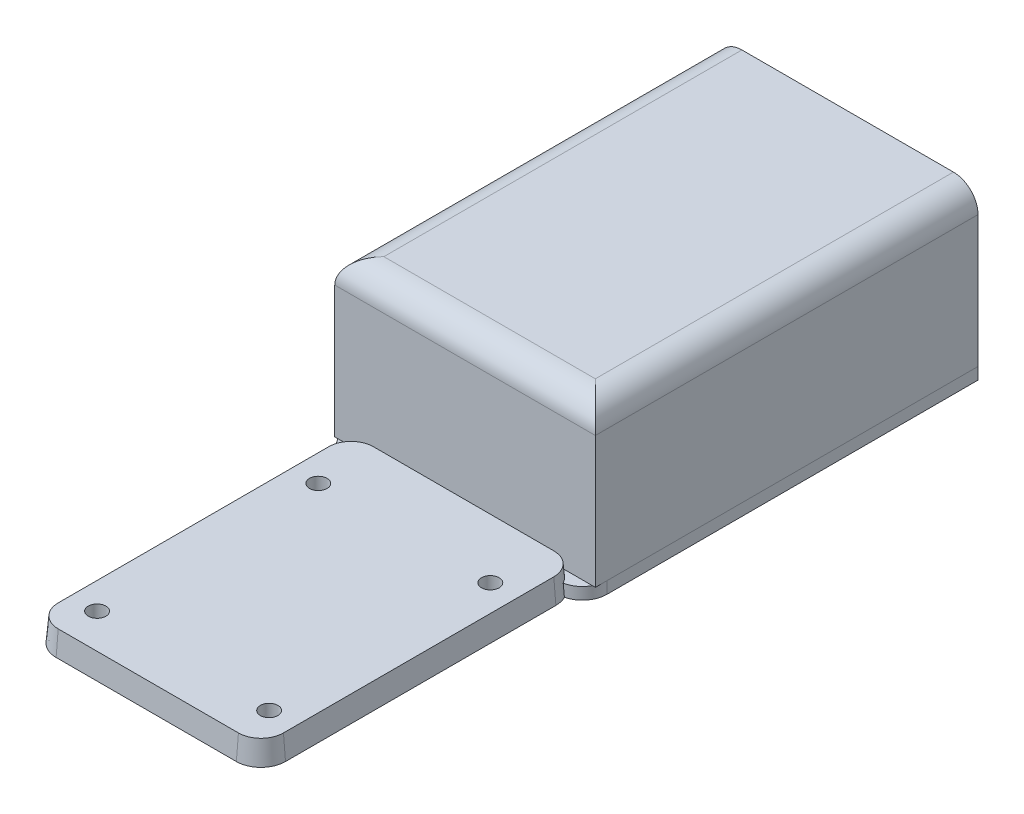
ISO-10303-21;
HEADER;
FILE_DESCRIPTION(('STEP AP214'),'2;1');
FILE_NAME('part.step','',(''),(''),'','','');
FILE_SCHEMA(('AUTOMOTIVE_DESIGN { 1 0 10303 214 1 1 1 1 }'));
ENDSEC;
DATA;
#1=APPLICATION_CONTEXT('core data for automotive mechanical design processes');
#2=APPLICATION_PROTOCOL_DEFINITION('international standard','automotive_design',2000,#1);
#3=PRODUCT_CONTEXT('',#1,'mechanical');
#4=PRODUCT('Part','Part','',(#3));
#5=PRODUCT_RELATED_PRODUCT_CATEGORY('part','',(#4));
#6=PRODUCT_DEFINITION_FORMATION('','',#4);
#7=PRODUCT_DEFINITION_CONTEXT('part definition',#1,'design');
#8=PRODUCT_DEFINITION('design','',#6,#7);
#9=PRODUCT_DEFINITION_SHAPE('','',#8);
#10=(LENGTH_UNIT() NAMED_UNIT(*) SI_UNIT(.MILLI.,.METRE.));
#11=(NAMED_UNIT(*) PLANE_ANGLE_UNIT() SI_UNIT($,.RADIAN.));
#12=(NAMED_UNIT(*) SI_UNIT($,.STERADIAN.) SOLID_ANGLE_UNIT());
#13=UNCERTAINTY_MEASURE_WITH_UNIT(LENGTH_MEASURE(1.E-05),#10,'distance_accuracy_value','');
#14=(GEOMETRIC_REPRESENTATION_CONTEXT(3) GLOBAL_UNCERTAINTY_ASSIGNED_CONTEXT((#13)) GLOBAL_UNIT_ASSIGNED_CONTEXT((#10,
#11,#12)) REPRESENTATION_CONTEXT('',''));
#15=CARTESIAN_POINT('',(0.,0.,0.));
#16=DIRECTION('',(0.,0.,1.));
#17=DIRECTION('',(1.,0.,0.));
#18=AXIS2_PLACEMENT_3D('',#15,#16,#17);
#19=CARTESIAN_POINT('',(25.8877703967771,2.9,-41.5875747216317));
#20=DIRECTION('',(0.,-1.,0.));
#21=DIRECTION('',(0.,0.,-1.));
#22=AXIS2_PLACEMENT_3D('',#19,#20,#21);
#23=PLANE('',#22);
#24=DIRECTION('',(-1.,0.,0.));
#25=VECTOR('',#24,1.);
#26=CARTESIAN_POINT('',(25.8877703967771,2.9,-132.150001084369));
#27=LINE('',#26,#25);
#28=CARTESIAN_POINT('',(31.8877703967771,2.9,-132.150001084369));
#29=VERTEX_POINT('',#28);
#30=CARTESIAN_POINT('',(-31.6747409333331,2.9,-132.150001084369));
#31=VERTEX_POINT('',#30);
#32=EDGE_CURVE('E527',#29,#31,#27,.T.);
#33=ORIENTED_EDGE('',*,*,#32,.F.);
#34=DIRECTION('',(0.,0.,1.));
#35=VECTOR('',#34,1.);
#36=CARTESIAN_POINT('',(31.8877703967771,2.9,-41.5875747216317));
#37=LINE('',#36,#35);
#38=CARTESIAN_POINT('',(31.8877703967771,2.9,-132.155434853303));
#39=VERTEX_POINT('',#38);
#40=EDGE_CURVE('E306',#39,#29,#37,.T.);
#41=ORIENTED_EDGE('',*,*,#40,.F.);
#42=DIRECTION('',(1.,0.,0.));
#43=VECTOR('',#42,1.);
#44=CARTESIAN_POINT('',(-31.6747409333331,2.9,-132.155434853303));
#45=LINE('',#44,#43);
#46=CARTESIAN_POINT('',(-31.6747409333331,2.9,-132.155434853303));
#47=VERTEX_POINT('',#46);
#48=EDGE_CURVE('E302',#47,#39,#45,.T.);
#49=ORIENTED_EDGE('',*,*,#48,.F.);
#50=DIRECTION('',(0.,0.,-1.));
#51=VECTOR('',#50,1.);
#52=CARTESIAN_POINT('',(-31.6747409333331,2.9,-41.5875747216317));
#53=LINE('',#52,#51);
#54=EDGE_CURVE('E298',#31,#47,#53,.T.);
#55=ORIENTED_EDGE('',*,*,#54,.F.);
#56=EDGE_LOOP('',(#33,#41,#49,#55));
#57=FACE_BOUND('',#56,.T.);
#58=ADVANCED_FACE('F34',(#57),#23,.F.);
#59=DIRECTION('',(1.,0.,0.));
#60=VECTOR('',#59,1.);
#61=CARTESIAN_POINT('',(25.8877703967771,2.9,-38.7462828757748));
#62=LINE('',#61,#60);
#63=CARTESIAN_POINT('',(-30.9593469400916,2.9,-38.7462828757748));
#64=VERTEX_POINT('',#63);
#65=CARTESIAN_POINT('',(-22.,2.9,-38.7462828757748));
#66=VERTEX_POINT('',#65);
#67=EDGE_CURVE('E430',#64,#66,#62,.T.);
#68=ORIENTED_EDGE('',*,*,#67,.F.);
#69=CARTESIAN_POINT('',(-25.6747409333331,2.9,-41.5875747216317));
#70=DIRECTION('',(0.,-1.,0.));
#71=DIRECTION('',(0.,0.,1.));
#72=AXIS2_PLACEMENT_3D('',#69,#70,#71);
#73=CIRCLE('',#72,6.);
#74=CARTESIAN_POINT('',(-27.0473257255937,2.9,-35.7466834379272));
#75=VERTEX_POINT('',#74);
#76=EDGE_CURVE('E295',#75,#64,#73,.T.);
#77=ORIENTED_EDGE('',*,*,#76,.F.);
#78=CARTESIAN_POINT('',(-22.,2.9,-33.));
#79=DIRECTION('',(0.,-1.,0.));
#80=DIRECTION('',(0.,0.,-1.));
#81=AXIS2_PLACEMENT_3D('',#78,#79,#80);
#82=CIRCLE('',#81,5.74628287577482);
#83=EDGE_CURVE('E431',#75,#66,#82,.T.);
#84=ORIENTED_EDGE('',*,*,#83,.T.);
#85=EDGE_LOOP('',(#68,#77,#84));
#86=FACE_BOUND('',#85,.T.);
#87=ADVANCED_FACE('F403',(#86),#23,.F.);
#88=CARTESIAN_POINT('',(22.,2.9,-38.7462828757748));
#89=VERTEX_POINT('',#88);
#90=CARTESIAN_POINT('',(31.1723764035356,2.9,-38.7462828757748));
#91=VERTEX_POINT('',#90);
#92=EDGE_CURVE('E423',#89,#91,#62,.T.);
#93=ORIENTED_EDGE('',*,*,#92,.F.);
#94=CARTESIAN_POINT('',(22.,2.9,-33.));
#95=DIRECTION('',(0.,-1.,0.));
#96=DIRECTION('',(0.,0.,-1.));
#97=AXIS2_PLACEMENT_3D('',#94,#95,#96);
#98=CIRCLE('',#97,5.74628287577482);
#99=CARTESIAN_POINT('',(27.0697114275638,2.9,-35.7051419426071));
#100=VERTEX_POINT('',#99);
#101=EDGE_CURVE('E425',#89,#100,#98,.T.);
#102=ORIENTED_EDGE('',*,*,#101,.T.);
#103=CARTESIAN_POINT('',(25.8877703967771,2.9,-41.5875747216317));
#104=DIRECTION('',(0.,-1.,0.));
#105=DIRECTION('',(0.,0.,-1.));
#106=AXIS2_PLACEMENT_3D('',#103,#104,#105);
#107=CIRCLE('',#106,5.99999999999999);
#108=EDGE_CURVE('E294',#91,#100,#107,.T.);
#109=ORIENTED_EDGE('',*,*,#108,.F.);
#110=EDGE_LOOP('',(#93,#102,#109));
#111=FACE_BOUND('',#110,.T.);
#112=ADVANCED_FACE('F406',(#111),#23,.F.);
#113=CARTESIAN_POINT('',(22.,0.,-39.));
#114=DIRECTION('',(0.,0.0871557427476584,-0.996194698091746));
#115=DIRECTION('',(0.,0.996194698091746,0.0871557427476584));
#116=AXIS2_PLACEMENT_3D('',#113,#114,#115);
#117=PLANE('',#116);
#118=DIRECTION('',(-1.,0.,0.));
#119=VECTOR('',#118,1.);
#120=CARTESIAN_POINT('',(22.,2.9,-38.7462828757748));
#121=LINE('',#120,#119);
#122=EDGE_CURVE('E442',#66,#89,#121,.F.);
#123=ORIENTED_EDGE('',*,*,#122,.F.);
#124=DIRECTION('',(0.,-0.996194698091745,-0.0871557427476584));
#125=VECTOR('',#124,1.);
#126=CARTESIAN_POINT('',(-22.,0.,-39.));
#127=LINE('',#126,#125);
#128=CARTESIAN_POINT('',(-22.,5.8,-38.4925657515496));
#129=VERTEX_POINT('',#128);
#130=EDGE_CURVE('E448',#129,#66,#127,.T.);
#131=ORIENTED_EDGE('',*,*,#130,.F.);
#132=DIRECTION('',(1.,0.,0.));
#133=VECTOR('',#132,1.);
#134=CARTESIAN_POINT('',(22.,5.8,-38.4925657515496));
#135=LINE('',#134,#133);
#136=CARTESIAN_POINT('',(22.,5.8,-38.4925657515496));
#137=VERTEX_POINT('',#136);
#138=EDGE_CURVE('E446',#137,#129,#135,.F.);
#139=ORIENTED_EDGE('',*,*,#138,.F.);
#140=DIRECTION('',(0.,-0.996194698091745,-0.0871557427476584));
#141=VECTOR('',#140,1.);
#142=CARTESIAN_POINT('',(22.,0.,-39.));
#143=LINE('',#142,#141);
#144=EDGE_CURVE('E438',#137,#89,#143,.T.);
#145=ORIENTED_EDGE('',*,*,#144,.T.);
#146=EDGE_LOOP('',(#123,#131,#139,#145));
#147=FACE_BOUND('',#146,.T.);
#148=ADVANCED_FACE('F391',(#147),#117,.T.);
#149=CARTESIAN_POINT('',(-22.,0.,33.));
#150=DIRECTION('',(0.,-1.,0.));
#151=DIRECTION('',(0.,0.,1.));
#152=AXIS2_PLACEMENT_3D('',#149,#150,#151);
#153=CONICAL_SURFACE('',#152,6.,0.0872664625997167);
#154=CARTESIAN_POINT('',(-22.,0.,33.));
#155=DIRECTION('',(0.,1.,0.));
#156=DIRECTION('',(0.,0.,1.));
#157=AXIS2_PLACEMENT_3D('',#154,#155,#156);
#158=CIRCLE('',#157,6.);
#159=CARTESIAN_POINT('',(-28.,0.,33.));
#160=VERTEX_POINT('',#159);
#161=CARTESIAN_POINT('',(-22.,0.,39.));
#162=VERTEX_POINT('',#161);
#163=EDGE_CURVE('E476',#160,#162,#158,.T.);
#164=ORIENTED_EDGE('',*,*,#163,.T.);
#165=DIRECTION('',(0.,-0.996194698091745,0.0871557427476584));
#166=VECTOR('',#165,1.);
#167=CARTESIAN_POINT('',(-22.,0.,39.));
#168=LINE('',#167,#166);
#169=CARTESIAN_POINT('',(-22.,5.8,38.4925657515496));
#170=VERTEX_POINT('',#169);
#171=EDGE_CURVE('E492',#170,#162,#168,.T.);
#172=ORIENTED_EDGE('',*,*,#171,.F.);
#173=CARTESIAN_POINT('',(-22.,5.8,33.));
#174=DIRECTION('',(0.,1.,0.));
#175=DIRECTION('',(0.,0.,1.));
#176=AXIS2_PLACEMENT_3D('',#173,#174,#175);
#177=CIRCLE('',#176,5.49256575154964);
#178=CARTESIAN_POINT('',(-27.4925657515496,5.8,33.));
#179=VERTEX_POINT('',#178);
#180=EDGE_CURVE('E491',#179,#170,#177,.T.);
#181=ORIENTED_EDGE('',*,*,#180,.F.);
#182=DIRECTION('',(-0.0871557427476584,-0.996194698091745,0.));
#183=VECTOR('',#182,1.);
#184=CARTESIAN_POINT('',(-28.,0.,33.));
#185=LINE('',#184,#183);
#186=EDGE_CURVE('E496',#179,#160,#185,.T.);
#187=ORIENTED_EDGE('',*,*,#186,.T.);
#188=EDGE_LOOP('',(#164,#172,#181,#187));
#189=FACE_BOUND('',#188,.T.);
#190=ADVANCED_FACE('F388',(#189),#153,.T.);
#191=CARTESIAN_POINT('',(22.,0.,39.));
#192=DIRECTION('',(0.,0.0871557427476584,0.996194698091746));
#193=DIRECTION('',(0.,-0.996194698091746,0.0871557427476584));
#194=AXIS2_PLACEMENT_3D('',#191,#192,#193);
#195=PLANE('',#194);
#196=DIRECTION('',(1.,0.,0.));
#197=VECTOR('',#196,1.);
#198=CARTESIAN_POINT('',(22.,0.,39.));
#199=LINE('',#198,#197);
#200=CARTESIAN_POINT('',(22.,0.,39.));
#201=VERTEX_POINT('',#200);
#202=EDGE_CURVE('E479',#162,#201,#199,.T.);
#203=ORIENTED_EDGE('',*,*,#202,.T.);
#204=DIRECTION('',(0.,-0.996194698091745,0.0871557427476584));
#205=VECTOR('',#204,1.);
#206=CARTESIAN_POINT('',(22.,0.,39.));
#207=LINE('',#206,#205);
#208=CARTESIAN_POINT('',(22.,5.8,38.4925657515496));
#209=VERTEX_POINT('',#208);
#210=EDGE_CURVE('E495',#209,#201,#207,.T.);
#211=ORIENTED_EDGE('',*,*,#210,.F.);
#212=DIRECTION('',(-1.,0.,0.));
#213=VECTOR('',#212,1.);
#214=CARTESIAN_POINT('',(22.,5.8,38.4925657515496));
#215=LINE('',#214,#213);
#216=EDGE_CURVE('E513',#170,#209,#215,.F.);
#217=ORIENTED_EDGE('',*,*,#216,.F.);
#218=ORIENTED_EDGE('',*,*,#171,.T.);
#219=EDGE_LOOP('',(#203,#211,#217,#218));
#220=FACE_BOUND('',#219,.T.);
#221=ADVANCED_FACE('F390',(#220),#195,.T.);
#222=CARTESIAN_POINT('',(22.,0.,33.));
#223=DIRECTION('',(0.,-1.,0.));
#224=DIRECTION('',(0.,0.,1.));
#225=AXIS2_PLACEMENT_3D('',#222,#223,#224);
#226=CONICAL_SURFACE('',#225,6.,0.0872664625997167);
#227=CARTESIAN_POINT('',(22.,0.,33.));
#228=DIRECTION('',(0.,1.,0.));
#229=DIRECTION('',(0.,0.,1.));
#230=AXIS2_PLACEMENT_3D('',#227,#228,#229);
#231=CIRCLE('',#230,6.);
#232=CARTESIAN_POINT('',(28.,0.,33.));
#233=VERTEX_POINT('',#232);
#234=EDGE_CURVE('E481',#201,#233,#231,.T.);
#235=ORIENTED_EDGE('',*,*,#234,.T.);
#236=DIRECTION('',(0.0871557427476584,-0.996194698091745,0.));
#237=VECTOR('',#236,1.);
#238=CARTESIAN_POINT('',(28.,0.,33.));
#239=LINE('',#238,#237);
#240=CARTESIAN_POINT('',(27.4925657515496,5.8,33.));
#241=VERTEX_POINT('',#240);
#242=EDGE_CURVE('E506',#241,#233,#239,.T.);
#243=ORIENTED_EDGE('',*,*,#242,.F.);
#244=CARTESIAN_POINT('',(22.,5.8,33.));
#245=DIRECTION('',(0.,1.,0.));
#246=DIRECTION('',(0.,0.,1.));
#247=AXIS2_PLACEMENT_3D('',#244,#245,#246);
#248=CIRCLE('',#247,5.49256575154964);
#249=EDGE_CURVE('E515',#209,#241,#248,.T.);
#250=ORIENTED_EDGE('',*,*,#249,.F.);
#251=ORIENTED_EDGE('',*,*,#210,.T.);
#252=EDGE_LOOP('',(#235,#243,#250,#251));
#253=FACE_BOUND('',#252,.T.);
#254=ADVANCED_FACE('F616',(#253),#226,.T.);
#255=CARTESIAN_POINT('',(28.,0.,33.));
#256=DIRECTION('',(0.996194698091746,0.0871557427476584,0.));
#257=DIRECTION('',(-0.0871557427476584,0.996194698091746,0.));
#258=AXIS2_PLACEMENT_3D('',#255,#256,#257);
#259=PLANE('',#258);
#260=DIRECTION('',(0.,0.,-1.));
#261=VECTOR('',#260,1.);
#262=CARTESIAN_POINT('',(28.,0.,33.));
#263=LINE('',#262,#261);
#264=CARTESIAN_POINT('',(28.,0.,-33.));
#265=VERTEX_POINT('',#264);
#266=EDGE_CURVE('E483',#233,#265,#263,.T.);
#267=ORIENTED_EDGE('',*,*,#266,.T.);
#268=DIRECTION('',(0.0871557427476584,-0.996194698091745,0.));
#269=VECTOR('',#268,1.);
#270=CARTESIAN_POINT('',(28.,0.,-33.));
#271=LINE('',#270,#269);
#272=CARTESIAN_POINT('',(27.4925657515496,5.8,-33.));
#273=VERTEX_POINT('',#272);
#274=EDGE_CURVE('E447',#273,#265,#271,.T.);
#275=ORIENTED_EDGE('',*,*,#274,.F.);
#276=DIRECTION('',(0.,0.,1.));
#277=VECTOR('',#276,1.);
#278=CARTESIAN_POINT('',(27.4925657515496,5.8,33.));
#279=LINE('',#278,#277);
#280=EDGE_CURVE('E517',#241,#273,#279,.F.);
#281=ORIENTED_EDGE('',*,*,#280,.F.);
#282=ORIENTED_EDGE('',*,*,#242,.T.);
#283=EDGE_LOOP('',(#267,#275,#281,#282));
#284=FACE_BOUND('',#283,.T.);
#285=ADVANCED_FACE('F617',(#284),#259,.T.);
#286=CARTESIAN_POINT('',(22.,0.,-33.));
#287=DIRECTION('',(0.,-1.,0.));
#288=DIRECTION('',(0.,0.,1.));
#289=AXIS2_PLACEMENT_3D('',#286,#287,#288);
#290=CONICAL_SURFACE('',#289,6.,0.0872664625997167);
#291=CARTESIAN_POINT('',(22.,0.,-33.));
#292=DIRECTION('',(0.,1.,0.));
#293=DIRECTION('',(0.,0.,1.));
#294=AXIS2_PLACEMENT_3D('',#291,#292,#293);
#295=CIRCLE('',#294,6.);
#296=CARTESIAN_POINT('',(27.326192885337,0.,-35.7625476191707));
#297=VERTEX_POINT('',#296);
#298=EDGE_CURVE('E485',#265,#297,#295,.T.);
#299=ORIENTED_EDGE('',*,*,#298,.T.);
#300=CARTESIAN_POINT('',(27.3262103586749,-0.000200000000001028,-35.7625519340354));
#301=CARTESIAN_POINT('',(27.2839851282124,0.483229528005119,-35.7521175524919));
#302=CARTESIAN_POINT('',(27.2414961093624,0.966644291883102,-35.7421158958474));
#303=CARTESIAN_POINT('',(27.1559904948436,1.93344429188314,-35.7229780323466));
#304=CARTESIAN_POINT('',(27.1129738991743,2.41682952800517,-35.7138418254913));
#305=CARTESIAN_POINT('',(27.069693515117,2.90020000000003,-35.7051383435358));
#306=B_SPLINE_CURVE_WITH_KNOTS('',3,(#300,#301,#302,#303,#304,#305),.UNSPECIFIED.,.F.,.F.,(4,2,
4),(0.,1.45614444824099,2.91228889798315),.UNSPECIFIED.);
#307=EDGE_CURVE('E339',#297,#100,#306,.T.);
#308=ORIENTED_EDGE('',*,*,#307,.T.);
#309=ORIENTED_EDGE('',*,*,#101,.F.);
#310=ORIENTED_EDGE('',*,*,#144,.F.);
#311=CARTESIAN_POINT('',(22.,5.8,-33.));
#312=DIRECTION('',(0.,1.,0.));
#313=DIRECTION('',(0.,0.,1.));
#314=AXIS2_PLACEMENT_3D('',#311,#312,#313);
#315=CIRCLE('',#314,5.49256575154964);
#316=EDGE_CURVE('E519',#273,#137,#315,.T.);
#317=ORIENTED_EDGE('',*,*,#316,.F.);
#318=ORIENTED_EDGE('',*,*,#274,.T.);
#319=EDGE_LOOP('',(#299,#308,#309,#310,#317,#318));
#320=FACE_BOUND('',#319,.T.);
#321=ADVANCED_FACE('F400',(#320),#290,.T.);
#322=CARTESIAN_POINT('',(-22.,0.,-33.));
#323=DIRECTION('',(0.,-1.,0.));
#324=DIRECTION('',(0.,0.,1.));
#325=AXIS2_PLACEMENT_3D('',#322,#323,#324);
#326=CONICAL_SURFACE('',#325,6.,0.0872664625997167);
#327=ORIENTED_EDGE('',*,*,#83,.F.);
#328=CARTESIAN_POINT('',(-27.0473080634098,2.9002,-35.7466792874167));
#329=CARTESIAN_POINT('',(-27.0899854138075,2.41682580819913,-35.7567146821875));
#330=CARTESIAN_POINT('',(-27.1324055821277,1.93343871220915,-35.7671733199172));
#331=CARTESIAN_POINT('',(-27.216731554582,0.966638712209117,-35.7889370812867));
#332=CARTESIAN_POINT('',(-27.2586373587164,0.483225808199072,-35.8002422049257));
#333=CARTESIAN_POINT('',(-27.3002859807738,-0.000200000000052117,-35.8119705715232));
#334=B_SPLINE_CURVE_WITH_KNOTS('',3,(#328,#329,#330,#331,#332,#333),.UNSPECIFIED.,.F.,.F.,(4,2,
4),(0.,1.45607260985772,2.91214521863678),.UNSPECIFIED.);
#335=CARTESIAN_POINT('',(-27.3002687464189,0.,-35.8119657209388));
#336=VERTEX_POINT('',#335);
#337=EDGE_CURVE('E325',#75,#336,#334,.T.);
#338=ORIENTED_EDGE('',*,*,#337,.T.);
#339=CARTESIAN_POINT('',(-22.,0.,-33.));
#340=DIRECTION('',(0.,1.,0.));
#341=DIRECTION('',(0.,0.,1.));
#342=AXIS2_PLACEMENT_3D('',#339,#340,#341);
#343=CIRCLE('',#342,6.);
#344=CARTESIAN_POINT('',(-28.,0.,-33.));
#345=VERTEX_POINT('',#344);
#346=EDGE_CURVE('E487',#336,#345,#343,.T.);
#347=ORIENTED_EDGE('',*,*,#346,.T.);
#348=DIRECTION('',(-0.0871557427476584,-0.996194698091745,0.));
#349=VECTOR('',#348,1.);
#350=CARTESIAN_POINT('',(-28.,0.,-33.));
#351=LINE('',#350,#349);
#352=CARTESIAN_POINT('',(-27.4925657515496,5.8,-33.));
#353=VERTEX_POINT('',#352);
#354=EDGE_CURVE('E499',#353,#345,#351,.T.);
#355=ORIENTED_EDGE('',*,*,#354,.F.);
#356=CARTESIAN_POINT('',(-22.,5.8,-33.));
#357=DIRECTION('',(0.,1.,0.));
#358=DIRECTION('',(0.,0.,1.));
#359=AXIS2_PLACEMENT_3D('',#356,#357,#358);
#360=CIRCLE('',#359,5.49256575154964);
#361=EDGE_CURVE('E522',#129,#353,#360,.T.);
#362=ORIENTED_EDGE('',*,*,#361,.F.);
#363=ORIENTED_EDGE('',*,*,#130,.T.);
#364=EDGE_LOOP('',(#327,#338,#347,#355,#362,#363));
#365=FACE_BOUND('',#364,.T.);
#366=ADVANCED_FACE('F346',(#365),#326,.T.);
#367=CARTESIAN_POINT('',(-28.,0.,33.));
#368=DIRECTION('',(-0.996194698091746,0.0871557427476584,0.));
#369=DIRECTION('',(-0.0871557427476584,-0.996194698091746,0.));
#370=AXIS2_PLACEMENT_3D('',#367,#368,#369);
#371=PLANE('',#370);
#372=DIRECTION('',(0.,0.,1.));
#373=VECTOR('',#372,1.);
#374=CARTESIAN_POINT('',(-28.,0.,33.));
#375=LINE('',#374,#373);
#376=EDGE_CURVE('E489',#345,#160,#375,.T.);
#377=ORIENTED_EDGE('',*,*,#376,.T.);
#378=ORIENTED_EDGE('',*,*,#186,.F.);
#379=DIRECTION('',(0.,0.,-1.));
#380=VECTOR('',#379,1.);
#381=CARTESIAN_POINT('',(-27.4925657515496,5.8,33.));
#382=LINE('',#381,#380);
#383=EDGE_CURVE('E500',#353,#179,#382,.F.);
#384=ORIENTED_EDGE('',*,*,#383,.F.);
#385=ORIENTED_EDGE('',*,*,#354,.T.);
#386=EDGE_LOOP('',(#377,#378,#384,#385));
#387=FACE_BOUND('',#386,.T.);
#388=ADVANCED_FACE('F383',(#387),#371,.T.);
#389=CARTESIAN_POINT('',(-22.,5.8,33.));
#390=DIRECTION('',(0.,1.,0.));
#391=DIRECTION('',(0.,0.,1.));
#392=AXIS2_PLACEMENT_3D('',#389,#390,#391);
#393=PLANE('',#392);
#394=CARTESIAN_POINT('',(-21.,5.8,-24.));
#395=DIRECTION('',(0.,1.,0.));
#396=DIRECTION('',(0.,0.,1.));
#397=AXIS2_PLACEMENT_3D('',#394,#395,#396);
#398=CIRCLE('',#397,2.14999999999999);
#399=CARTESIAN_POINT('',(-21.,5.8,-21.85));
#400=VERTEX_POINT('',#399);
#401=EDGE_CURVE('E441',#400,#400,#398,.T.);
#402=ORIENTED_EDGE('',*,*,#401,.F.);
#403=EDGE_LOOP('',(#402));
#404=FACE_BOUND('',#403,.T.);
#405=CARTESIAN_POINT('',(21.,5.8,30.));
#406=DIRECTION('',(0.,1.,0.));
#407=DIRECTION('',(0.,0.,1.));
#408=AXIS2_PLACEMENT_3D('',#405,#406,#407);
#409=CIRCLE('',#408,2.14999999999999);
#410=CARTESIAN_POINT('',(21.,5.8,32.15));
#411=VERTEX_POINT('',#410);
#412=EDGE_CURVE('E458',#411,#411,#409,.T.);
#413=ORIENTED_EDGE('',*,*,#412,.F.);
#414=EDGE_LOOP('',(#413));
#415=FACE_BOUND('',#414,.T.);
#416=CARTESIAN_POINT('',(21.,5.8,-24.));
#417=DIRECTION('',(0.,1.,0.));
#418=DIRECTION('',(0.,0.,1.));
#419=AXIS2_PLACEMENT_3D('',#416,#417,#418);
#420=CIRCLE('',#419,2.14999999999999);
#421=CARTESIAN_POINT('',(21.,5.8,-21.85));
#422=VERTEX_POINT('',#421);
#423=EDGE_CURVE('E464',#422,#422,#420,.T.);
#424=ORIENTED_EDGE('',*,*,#423,.F.);
#425=EDGE_LOOP('',(#424));
#426=FACE_BOUND('',#425,.T.);
#427=CARTESIAN_POINT('',(-21.,5.8,30.));
#428=DIRECTION('',(0.,1.,0.));
#429=DIRECTION('',(0.,0.,1.));
#430=AXIS2_PLACEMENT_3D('',#427,#428,#429);
#431=CIRCLE('',#430,2.14999999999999);
#432=CARTESIAN_POINT('',(-21.,5.8,32.15));
#433=VERTEX_POINT('',#432);
#434=EDGE_CURVE('E470',#433,#433,#431,.T.);
#435=ORIENTED_EDGE('',*,*,#434,.F.);
#436=EDGE_LOOP('',(#435));
#437=FACE_BOUND('',#436,.T.);
#438=ORIENTED_EDGE('',*,*,#180,.T.);
#439=ORIENTED_EDGE('',*,*,#216,.T.);
#440=ORIENTED_EDGE('',*,*,#249,.T.);
#441=ORIENTED_EDGE('',*,*,#280,.T.);
#442=ORIENTED_EDGE('',*,*,#316,.T.);
#443=ORIENTED_EDGE('',*,*,#138,.T.);
#444=ORIENTED_EDGE('',*,*,#361,.T.);
#445=ORIENTED_EDGE('',*,*,#383,.T.);
#446=EDGE_LOOP('',(#438,#439,#440,#441,#442,#443,#444,#445));
#447=FACE_BOUND('',#446,.T.);
#448=ADVANCED_FACE('F380',(#404,#415,#426,#437,#447),#393,.T.);
#449=CARTESIAN_POINT('',(-22.,0.,33.));
#450=DIRECTION('',(0.,1.,0.));
#451=DIRECTION('',(0.,0.,1.));
#452=AXIS2_PLACEMENT_3D('',#449,#450,#451);
#453=PLANE('',#452);
#454=CARTESIAN_POINT('',(25.8877703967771,0.,-41.5875747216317));
#455=DIRECTION('',(0.,-1.,0.));
#456=DIRECTION('',(0.,0.,-1.));
#457=AXIS2_PLACEMENT_3D('',#454,#455,#456);
#458=CIRCLE('',#457,5.99999999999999);
#459=CARTESIAN_POINT('',(31.8877703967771,0.,-41.5875747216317));
#460=VERTEX_POINT('',#459);
#461=EDGE_CURVE('E290',#460,#297,#458,.T.);
#462=ORIENTED_EDGE('',*,*,#461,.T.);
#463=ORIENTED_EDGE('',*,*,#298,.F.);
#464=ORIENTED_EDGE('',*,*,#266,.F.);
#465=ORIENTED_EDGE('',*,*,#234,.F.);
#466=ORIENTED_EDGE('',*,*,#202,.F.);
#467=ORIENTED_EDGE('',*,*,#163,.F.);
#468=ORIENTED_EDGE('',*,*,#376,.F.);
#469=ORIENTED_EDGE('',*,*,#346,.F.);
#470=CARTESIAN_POINT('',(-25.6747409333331,0.,-41.5875747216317));
#471=DIRECTION('',(0.,-1.,0.));
#472=DIRECTION('',(0.,0.,1.));
#473=AXIS2_PLACEMENT_3D('',#470,#471,#472);
#474=CIRCLE('',#473,6.);
#475=CARTESIAN_POINT('',(-31.6747409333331,0.,-41.5875747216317));
#476=VERTEX_POINT('',#475);
#477=EDGE_CURVE('E312',#336,#476,#474,.T.);
#478=ORIENTED_EDGE('',*,*,#477,.T.);
#479=DIRECTION('',(0.,0.,-1.));
#480=VECTOR('',#479,1.);
#481=CARTESIAN_POINT('',(-31.6747409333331,0.,-41.5875747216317));
#482=LINE('',#481,#480);
#483=CARTESIAN_POINT('',(-31.6747409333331,0.,-132.155434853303));
#484=VERTEX_POINT('',#483);
#485=EDGE_CURVE('E314',#476,#484,#482,.T.);
#486=ORIENTED_EDGE('',*,*,#485,.T.);
#487=DIRECTION('',(1.,0.,0.));
#488=VECTOR('',#487,1.);
#489=CARTESIAN_POINT('',(-31.6747409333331,0.,-132.155434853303));
#490=LINE('',#489,#488);
#491=CARTESIAN_POINT('',(31.8877703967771,0.,-132.155434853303));
#492=VERTEX_POINT('',#491);
#493=EDGE_CURVE('E317',#484,#492,#490,.T.);
#494=ORIENTED_EDGE('',*,*,#493,.T.);
#495=DIRECTION('',(0.,0.,1.));
#496=VECTOR('',#495,1.);
#497=CARTESIAN_POINT('',(31.8877703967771,0.,-41.5875747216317));
#498=LINE('',#497,#496);
#499=EDGE_CURVE('E320',#492,#460,#498,.T.);
#500=ORIENTED_EDGE('',*,*,#499,.T.);
#501=EDGE_LOOP('',(#462,#463,#464,#465,#466,#467,#468,#469,#478,#486,#494,#500));
#502=FACE_BOUND('',#501,.T.);
#503=CARTESIAN_POINT('',(-21.,0.,-24.));
#504=DIRECTION('',(0.,1.,0.));
#505=DIRECTION('',(0.,0.,1.));
#506=AXIS2_PLACEMENT_3D('',#503,#504,#505);
#507=CIRCLE('',#506,2.15);
#508=CARTESIAN_POINT('',(-21.,0.,-21.85));
#509=VERTEX_POINT('',#508);
#510=EDGE_CURVE('E455',#509,#509,#507,.T.);
#511=ORIENTED_EDGE('',*,*,#510,.T.);
#512=EDGE_LOOP('',(#511));
#513=FACE_BOUND('',#512,.T.);
#514=CARTESIAN_POINT('',(21.,0.,30.));
#515=DIRECTION('',(0.,1.,0.));
#516=DIRECTION('',(0.,0.,1.));
#517=AXIS2_PLACEMENT_3D('',#514,#515,#516);
#518=CIRCLE('',#517,2.15);
#519=CARTESIAN_POINT('',(21.,0.,32.15));
#520=VERTEX_POINT('',#519);
#521=EDGE_CURVE('E461',#520,#520,#518,.T.);
#522=ORIENTED_EDGE('',*,*,#521,.T.);
#523=EDGE_LOOP('',(#522));
#524=FACE_BOUND('',#523,.T.);
#525=CARTESIAN_POINT('',(21.,0.,-24.));
#526=DIRECTION('',(0.,1.,0.));
#527=DIRECTION('',(0.,0.,1.));
#528=AXIS2_PLACEMENT_3D('',#525,#526,#527);
#529=CIRCLE('',#528,2.15);
#530=CARTESIAN_POINT('',(21.,0.,-21.85));
#531=VERTEX_POINT('',#530);
#532=EDGE_CURVE('E467',#531,#531,#529,.T.);
#533=ORIENTED_EDGE('',*,*,#532,.T.);
#534=EDGE_LOOP('',(#533));
#535=FACE_BOUND('',#534,.T.);
#536=CARTESIAN_POINT('',(-21.,0.,30.));
#537=DIRECTION('',(0.,1.,0.));
#538=DIRECTION('',(0.,0.,1.));
#539=AXIS2_PLACEMENT_3D('',#536,#537,#538);
#540=CIRCLE('',#539,2.15);
#541=CARTESIAN_POINT('',(-21.,0.,32.15));
#542=VERTEX_POINT('',#541);
#543=EDGE_CURVE('E473',#542,#542,#540,.T.);
#544=ORIENTED_EDGE('',*,*,#543,.T.);
#545=EDGE_LOOP('',(#544));
#546=FACE_BOUND('',#545,.T.);
#547=ADVANCED_FACE('F378',(#502,#513,#524,#535,#546),#453,.F.);
#548=CARTESIAN_POINT('',(-21.,5.8,30.));
#549=DIRECTION('',(0.,1.,0.));
#550=DIRECTION('',(0.,0.,1.));
#551=AXIS2_PLACEMENT_3D('',#548,#549,#550);
#552=CYLINDRICAL_SURFACE('',#551,2.14999999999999);
#553=ORIENTED_EDGE('',*,*,#543,.F.);
#554=EDGE_LOOP('',(#553));
#555=FACE_BOUND('',#554,.T.);
#556=ORIENTED_EDGE('',*,*,#434,.T.);
#557=EDGE_LOOP('',(#556));
#558=FACE_BOUND('',#557,.T.);
#559=ADVANCED_FACE('F374',(#555,#558),#552,.F.);
#560=CARTESIAN_POINT('',(21.,5.8,-24.));
#561=DIRECTION('',(0.,1.,0.));
#562=DIRECTION('',(0.,0.,1.));
#563=AXIS2_PLACEMENT_3D('',#560,#561,#562);
#564=CYLINDRICAL_SURFACE('',#563,2.14999999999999);
#565=ORIENTED_EDGE('',*,*,#532,.F.);
#566=EDGE_LOOP('',(#565));
#567=FACE_BOUND('',#566,.T.);
#568=ORIENTED_EDGE('',*,*,#423,.T.);
#569=EDGE_LOOP('',(#568));
#570=FACE_BOUND('',#569,.T.);
#571=ADVANCED_FACE('F370',(#567,#570),#564,.F.);
#572=CARTESIAN_POINT('',(21.,5.8,30.));
#573=DIRECTION('',(0.,1.,0.));
#574=DIRECTION('',(0.,0.,1.));
#575=AXIS2_PLACEMENT_3D('',#572,#573,#574);
#576=CYLINDRICAL_SURFACE('',#575,2.14999999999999);
#577=ORIENTED_EDGE('',*,*,#521,.F.);
#578=EDGE_LOOP('',(#577));
#579=FACE_BOUND('',#578,.T.);
#580=ORIENTED_EDGE('',*,*,#412,.T.);
#581=EDGE_LOOP('',(#580));
#582=FACE_BOUND('',#581,.T.);
#583=ADVANCED_FACE('F366',(#579,#582),#576,.F.);
#584=CARTESIAN_POINT('',(-21.,5.8,-24.));
#585=DIRECTION('',(0.,1.,0.));
#586=DIRECTION('',(0.,0.,1.));
#587=AXIS2_PLACEMENT_3D('',#584,#585,#586);
#588=CYLINDRICAL_SURFACE('',#587,2.14999999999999);
#589=ORIENTED_EDGE('',*,*,#510,.F.);
#590=EDGE_LOOP('',(#589));
#591=FACE_BOUND('',#590,.T.);
#592=ORIENTED_EDGE('',*,*,#401,.T.);
#593=EDGE_LOOP('',(#592));
#594=FACE_BOUND('',#593,.T.);
#595=ADVANCED_FACE('F362',(#591,#594),#588,.F.);
#596=CARTESIAN_POINT('',(25.8877703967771,2.9,-41.5875747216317));
#597=DIRECTION('',(0.,-1.,0.));
#598=DIRECTION('',(0.,0.,-1.));
#599=AXIS2_PLACEMENT_3D('',#596,#597,#598);
#600=CYLINDRICAL_SURFACE('',#599,5.99999999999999);
#601=ORIENTED_EDGE('',*,*,#307,.F.);
#602=ORIENTED_EDGE('',*,*,#461,.F.);
#603=DIRECTION('',(0.,-1.,0.));
#604=VECTOR('',#603,1.);
#605=CARTESIAN_POINT('',(31.8877703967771,2.9,-41.5875747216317));
#606=LINE('',#605,#604);
#607=CARTESIAN_POINT('',(31.8877703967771,2.9,-41.5875747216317));
#608=VERTEX_POINT('',#607);
#609=EDGE_CURVE('E323',#608,#460,#606,.T.);
#610=ORIENTED_EDGE('',*,*,#609,.F.);
#611=EDGE_CURVE('E291',#608,#91,#107,.T.);
#612=ORIENTED_EDGE('',*,*,#611,.T.);
#613=ORIENTED_EDGE('',*,*,#108,.T.);
#614=EDGE_LOOP('',(#601,#602,#610,#612,#613));
#615=FACE_BOUND('',#614,.T.);
#616=ADVANCED_FACE('F355',(#615),#600,.T.);
#617=CARTESIAN_POINT('',(-25.6747409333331,2.9,-41.5875747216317));
#618=DIRECTION('',(0.,-1.,0.));
#619=DIRECTION('',(0.,0.,-1.));
#620=AXIS2_PLACEMENT_3D('',#617,#618,#619);
#621=CYLINDRICAL_SURFACE('',#620,6.);
#622=ORIENTED_EDGE('',*,*,#337,.F.);
#623=ORIENTED_EDGE('',*,*,#76,.T.);
#624=CARTESIAN_POINT('',(-31.6747409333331,2.9,-41.5875747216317));
#625=VERTEX_POINT('',#624);
#626=EDGE_CURVE('E293',#64,#625,#73,.T.);
#627=ORIENTED_EDGE('',*,*,#626,.T.);
#628=DIRECTION('',(0.,-1.,0.));
#629=VECTOR('',#628,1.);
#630=CARTESIAN_POINT('',(-31.6747409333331,2.9,-41.5875747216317));
#631=LINE('',#630,#629);
#632=EDGE_CURVE('E309',#625,#476,#631,.T.);
#633=ORIENTED_EDGE('',*,*,#632,.T.);
#634=ORIENTED_EDGE('',*,*,#477,.F.);
#635=EDGE_LOOP('',(#622,#623,#627,#633,#634));
#636=FACE_BOUND('',#635,.T.);
#637=ADVANCED_FACE('F350',(#636),#621,.T.);
#638=CARTESIAN_POINT('',(31.8877703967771,2.9,-41.5875747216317));
#639=DIRECTION('',(1.,0.,0.));
#640=DIRECTION('',(0.,0.,-1.));
#641=AXIS2_PLACEMENT_3D('',#638,#639,#640);
#642=PLANE('',#641);
#643=ORIENTED_EDGE('',*,*,#499,.F.);
#644=DIRECTION('',(0.,-1.,0.));
#645=VECTOR('',#644,1.);
#646=CARTESIAN_POINT('',(31.8877703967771,2.9,-132.155434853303));
#647=LINE('',#646,#645);
#648=EDGE_CURVE('E326',#39,#492,#647,.T.);
#649=ORIENTED_EDGE('',*,*,#648,.F.);
#650=ORIENTED_EDGE('',*,*,#40,.T.);
#651=EDGE_CURVE('E305',#29,#608,#37,.T.);
#652=ORIENTED_EDGE('',*,*,#651,.T.);
#653=ORIENTED_EDGE('',*,*,#609,.T.);
#654=EDGE_LOOP('',(#643,#649,#650,#652,#653));
#655=FACE_BOUND('',#654,.T.);
#656=ADVANCED_FACE('F354',(#655),#642,.T.);
#657=CARTESIAN_POINT('',(-31.6747409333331,2.9,-132.155434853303));
#658=DIRECTION('',(0.,0.,-1.));
#659=DIRECTION('',(-1.,0.,0.));
#660=AXIS2_PLACEMENT_3D('',#657,#658,#659);
#661=PLANE('',#660);
#662=ORIENTED_EDGE('',*,*,#493,.F.);
#663=DIRECTION('',(0.,-1.,0.));
#664=VECTOR('',#663,1.);
#665=CARTESIAN_POINT('',(-31.6747409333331,2.9,-132.155434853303));
#666=LINE('',#665,#664);
#667=EDGE_CURVE('E328',#47,#484,#666,.T.);
#668=ORIENTED_EDGE('',*,*,#667,.F.);
#669=ORIENTED_EDGE('',*,*,#48,.T.);
#670=ORIENTED_EDGE('',*,*,#648,.T.);
#671=EDGE_LOOP('',(#662,#668,#669,#670));
#672=FACE_BOUND('',#671,.T.);
#673=ADVANCED_FACE('F583',(#672),#661,.T.);
#674=CARTESIAN_POINT('',(-31.6747409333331,2.9,-41.5875747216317));
#675=DIRECTION('',(-1.,0.,0.));
#676=DIRECTION('',(0.,0.,1.));
#677=AXIS2_PLACEMENT_3D('',#674,#675,#676);
#678=PLANE('',#677);
#679=ORIENTED_EDGE('',*,*,#485,.F.);
#680=ORIENTED_EDGE('',*,*,#632,.F.);
#681=EDGE_CURVE('E299',#625,#31,#53,.T.);
#682=ORIENTED_EDGE('',*,*,#681,.T.);
#683=ORIENTED_EDGE('',*,*,#54,.T.);
#684=ORIENTED_EDGE('',*,*,#667,.T.);
#685=EDGE_LOOP('',(#679,#680,#682,#683,#684));
#686=FACE_BOUND('',#685,.T.);
#687=ADVANCED_FACE('F357',(#686),#678,.T.);
#688=CARTESIAN_POINT('',(0.,2.9,0.));
#689=DIRECTION('',(0.,1.,0.));
#690=DIRECTION('',(0.,0.,1.));
#691=AXIS2_PLACEMENT_3D('',#688,#689,#690);
#692=PLANE('',#691);
#693=ORIENTED_EDGE('',*,*,#611,.F.);
#694=ORIENTED_EDGE('',*,*,#651,.F.);
#695=DIRECTION('',(-1.,0.,0.));
#696=VECTOR('',#695,1.);
#697=CARTESIAN_POINT('',(31.8956037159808,2.9,-132.150001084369));
#698=LINE('',#697,#696);
#699=CARTESIAN_POINT('',(31.8956037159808,2.9,-132.150001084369));
#700=VERTEX_POINT('',#699);
#701=EDGE_CURVE('E274',#700,#29,#698,.T.);
#702=ORIENTED_EDGE('',*,*,#701,.F.);
#703=DIRECTION('',(0.,0.,-1.));
#704=VECTOR('',#703,1.);
#705=CARTESIAN_POINT('',(31.8956037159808,2.9,-38.7462828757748));
#706=LINE('',#705,#704);
#707=CARTESIAN_POINT('',(31.8956037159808,2.9,-38.7462828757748));
#708=VERTEX_POINT('',#707);
#709=EDGE_CURVE('E259',#708,#700,#706,.T.);
#710=ORIENTED_EDGE('',*,*,#709,.F.);
#711=DIRECTION('',(1.,0.,0.));
#712=VECTOR('',#711,1.);
#713=CARTESIAN_POINT('',(31.8956037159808,2.9,-38.7462828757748));
#714=LINE('',#713,#712);
#715=EDGE_CURVE('E280',#91,#708,#714,.T.);
#716=ORIENTED_EDGE('',*,*,#715,.F.);
#717=EDGE_LOOP('',(#693,#694,#702,#710,#716));
#718=FACE_BOUND('',#717,.T.);
#719=ADVANCED_FACE('F572',(#718),#692,.F.);
#720=CARTESIAN_POINT('',(31.8956037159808,41.,-38.7462828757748));
#721=DIRECTION('',(-1.,0.,0.));
#722=DIRECTION('',(0.,0.,1.));
#723=AXIS2_PLACEMENT_3D('',#720,#721,#722);
#724=PLANE('',#723);
#725=DIRECTION('',(0.,-1.,0.));
#726=VECTOR('',#725,1.);
#727=CARTESIAN_POINT('',(31.8956037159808,41.,-132.150001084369));
#728=LINE('',#727,#726);
#729=CARTESIAN_POINT('',(31.8956037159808,35.0056,-132.150001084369));
#730=VERTEX_POINT('',#729);
#731=EDGE_CURVE('E288',#730,#700,#728,.T.);
#732=ORIENTED_EDGE('',*,*,#731,.F.);
#733=DIRECTION('',(0.,0.,-1.));
#734=VECTOR('',#733,1.);
#735=CARTESIAN_POINT('',(31.8956037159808,35.0056,-38.7462828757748));
#736=LINE('',#735,#734);
#737=CARTESIAN_POINT('',(31.8956037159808,35.0056,-38.7462828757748));
#738=VERTEX_POINT('',#737);
#739=EDGE_CURVE('E11',#730,#738,#736,.F.);
#740=ORIENTED_EDGE('',*,*,#739,.T.);
#741=DIRECTION('',(0.,-1.,0.));
#742=VECTOR('',#741,1.);
#743=CARTESIAN_POINT('',(31.8956037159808,41.,-38.7462828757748));
#744=LINE('',#743,#742);
#745=EDGE_CURVE('E269',#738,#708,#744,.T.);
#746=ORIENTED_EDGE('',*,*,#745,.T.);
#747=ORIENTED_EDGE('',*,*,#709,.T.);
#748=EDGE_LOOP('',(#732,#740,#746,#747));
#749=FACE_BOUND('',#748,.T.);
#750=ADVANCED_FACE('F568',(#749),#724,.F.);
#751=CARTESIAN_POINT('',(31.8956037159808,41.,-132.150001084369));
#752=DIRECTION('',(0.,0.,1.));
#753=DIRECTION('',(1.,0.,0.));
#754=AXIS2_PLACEMENT_3D('',#751,#752,#753);
#755=PLANE('',#754);
#756=CARTESIAN_POINT('',(0.,37.3144877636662,-132.150001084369));
#757=DIRECTION('',(0.,0.,-1.));
#758=DIRECTION('',(-1.,0.,0.));
#759=AXIS2_PLACEMENT_3D('',#756,#757,#758);
#760=CIRCLE('',#759,1.24999999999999);
#761=CARTESIAN_POINT('',(-1.24999999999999,37.3144877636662,-132.150001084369));
#762=VERTEX_POINT('',#761);
#763=EDGE_CURVE('E223',#762,#762,#760,.T.);
#764=ORIENTED_EDGE('',*,*,#763,.F.);
#765=EDGE_LOOP('',(#764));
#766=FACE_BOUND('',#765,.T.);
#767=CARTESIAN_POINT('',(0.,5.04088159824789,-132.150001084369));
#768=DIRECTION('',(0.,0.,-1.));
#769=DIRECTION('',(-1.,0.,0.));
#770=AXIS2_PLACEMENT_3D('',#767,#768,#769);
#771=CIRCLE('',#770,1.24999999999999);
#772=CARTESIAN_POINT('',(-1.24999999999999,5.04088159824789,-132.150001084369));
#773=VERTEX_POINT('',#772);
#774=EDGE_CURVE('E222',#773,#773,#771,.T.);
#775=ORIENTED_EDGE('',*,*,#774,.F.);
#776=EDGE_LOOP('',(#775));
#777=FACE_BOUND('',#776,.T.);
#778=DIRECTION('',(-1.,0.,0.));
#779=VECTOR('',#778,1.);
#780=CARTESIAN_POINT('',(-29.0185123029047,8.49644698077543,-132.150001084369));
#781=LINE('',#780,#779);
#782=CARTESIAN_POINT('',(29.4014876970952,8.49644698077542,-132.150001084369));
#783=VERTEX_POINT('',#782);
#784=CARTESIAN_POINT('',(-29.0185123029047,8.49644698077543,-132.150001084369));
#785=VERTEX_POINT('',#784);
#786=EDGE_CURVE('E249',#783,#785,#781,.T.);
#787=ORIENTED_EDGE('',*,*,#786,.F.);
#788=DIRECTION('',(0.,-1.,0.));
#789=VECTOR('',#788,1.);
#790=CARTESIAN_POINT('',(29.4014876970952,33.8964469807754,-132.150001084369));
#791=LINE('',#790,#789);
#792=CARTESIAN_POINT('',(29.4014876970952,33.8964469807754,-132.150001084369));
#793=VERTEX_POINT('',#792);
#794=EDGE_CURVE('E233',#793,#783,#791,.T.);
#795=ORIENTED_EDGE('',*,*,#794,.F.);
#796=DIRECTION('',(1.,0.,0.));
#797=VECTOR('',#796,1.);
#798=CARTESIAN_POINT('',(-29.0185123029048,33.8964469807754,-132.150001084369));
#799=LINE('',#798,#797);
#800=CARTESIAN_POINT('',(-29.0185123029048,33.8964469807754,-132.150001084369));
#801=VERTEX_POINT('',#800);
#802=EDGE_CURVE('E238',#801,#793,#799,.T.);
#803=ORIENTED_EDGE('',*,*,#802,.F.);
#804=DIRECTION('',(0.,1.,0.));
#805=VECTOR('',#804,1.);
#806=CARTESIAN_POINT('',(-29.0185123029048,33.8964469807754,-132.150001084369));
#807=LINE('',#806,#805);
#808=EDGE_CURVE('E252',#785,#801,#807,.T.);
#809=ORIENTED_EDGE('',*,*,#808,.F.);
#810=EDGE_LOOP('',(#787,#795,#803,#809));
#811=FACE_BOUND('',#810,.T.);
#812=DIRECTION('',(0.,-1.,0.));
#813=VECTOR('',#812,1.);
#814=CARTESIAN_POINT('',(-31.7287352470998,41.,-132.150001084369));
#815=LINE('',#814,#813);
#816=CARTESIAN_POINT('',(-31.7287352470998,35.0056,-132.150001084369));
#817=VERTEX_POINT('',#816);
#818=CARTESIAN_POINT('',(-31.7287352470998,2.9,-132.150001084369));
#819=VERTEX_POINT('',#818);
#820=EDGE_CURVE('E286',#817,#819,#815,.T.);
#821=ORIENTED_EDGE('',*,*,#820,.F.);
#822=CARTESIAN_POINT('',(-25.7343352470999,35.0056,-132.150001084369));
#823=DIRECTION('',(0.,0.,1.));
#824=DIRECTION('',(1.,0.,0.));
#825=AXIS2_PLACEMENT_3D('',#822,#823,#824);
#826=CIRCLE('',#825,5.9944);
#827=CARTESIAN_POINT('',(-25.7343352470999,41.,-132.150001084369));
#828=VERTEX_POINT('',#827);
#829=EDGE_CURVE('E540',#817,#828,#826,.F.);
#830=ORIENTED_EDGE('',*,*,#829,.T.);
#831=DIRECTION('',(-1.,0.,0.));
#832=VECTOR('',#831,1.);
#833=CARTESIAN_POINT('',(31.8956037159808,41.,-132.150001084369));
#834=LINE('',#833,#832);
#835=CARTESIAN_POINT('',(25.9012037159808,41.,-132.150001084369));
#836=VERTEX_POINT('',#835);
#837=EDGE_CURVE('E266',#836,#828,#834,.T.);
#838=ORIENTED_EDGE('',*,*,#837,.F.);
#839=CARTESIAN_POINT('',(25.9012037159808,35.0056,-132.150001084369));
#840=DIRECTION('',(0.,0.,1.));
#841=DIRECTION('',(1.,0.,0.));
#842=AXIS2_PLACEMENT_3D('',#839,#840,#841);
#843=CIRCLE('',#842,5.9944);
#844=EDGE_CURVE('E57',#836,#730,#843,.F.);
#845=ORIENTED_EDGE('',*,*,#844,.T.);
#846=ORIENTED_EDGE('',*,*,#731,.T.);
#847=ORIENTED_EDGE('',*,*,#701,.T.);
#848=ORIENTED_EDGE('',*,*,#32,.T.);
#849=EDGE_CURVE('E273',#31,#819,#698,.T.);
#850=ORIENTED_EDGE('',*,*,#849,.T.);
#851=EDGE_LOOP('',(#821,#830,#838,#845,#846,#847,#848,#850));
#852=FACE_BOUND('',#851,.T.);
#853=ADVANCED_FACE('F558',(#766,#777,#811,#852),#755,.F.);
#854=CARTESIAN_POINT('',(-31.7287352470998,41.,-38.7462828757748));
#855=DIRECTION('',(1.,0.,0.));
#856=DIRECTION('',(0.,0.,-1.));
#857=AXIS2_PLACEMENT_3D('',#854,#855,#856);
#858=PLANE('',#857);
#859=DIRECTION('',(0.,-1.,0.));
#860=VECTOR('',#859,1.);
#861=CARTESIAN_POINT('',(-31.7287352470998,41.,-38.7462828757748));
#862=LINE('',#861,#860);
#863=CARTESIAN_POINT('',(-31.7287352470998,35.0056,-38.7462828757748));
#864=VERTEX_POINT('',#863);
#865=CARTESIAN_POINT('',(-31.7287352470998,2.9,-38.7462828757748));
#866=VERTEX_POINT('',#865);
#867=EDGE_CURVE('E284',#864,#866,#862,.T.);
#868=ORIENTED_EDGE('',*,*,#867,.F.);
#869=DIRECTION('',(0.,0.,1.));
#870=VECTOR('',#869,1.);
#871=CARTESIAN_POINT('',(-31.7287352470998,35.0056,-132.150001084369));
#872=LINE('',#871,#870);
#873=EDGE_CURVE('E537',#864,#817,#872,.F.);
#874=ORIENTED_EDGE('',*,*,#873,.T.);
#875=ORIENTED_EDGE('',*,*,#820,.T.);
#876=DIRECTION('',(0.,0.,1.));
#877=VECTOR('',#876,1.);
#878=CARTESIAN_POINT('',(-31.7287352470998,2.9,-38.7462828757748));
#879=LINE('',#878,#877);
#880=EDGE_CURVE('E277',#819,#866,#879,.T.);
#881=ORIENTED_EDGE('',*,*,#880,.T.);
#882=EDGE_LOOP('',(#868,#874,#875,#881));
#883=FACE_BOUND('',#882,.T.);
#884=ADVANCED_FACE('F564',(#883),#858,.F.);
#885=CARTESIAN_POINT('',(31.8956037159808,41.,-38.7462828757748));
#886=DIRECTION('',(0.,0.,-1.));
#887=DIRECTION('',(-1.,0.,0.));
#888=AXIS2_PLACEMENT_3D('',#885,#886,#887);
#889=PLANE('',#888);
#890=ORIENTED_EDGE('',*,*,#745,.F.);
#891=DIRECTION('',(1.,0.,0.));
#892=VECTOR('',#891,1.);
#893=CARTESIAN_POINT('',(-31.7287352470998,35.0056,-38.7462828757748));
#894=LINE('',#893,#892);
#895=EDGE_CURVE('E43',#738,#864,#894,.F.);
#896=ORIENTED_EDGE('',*,*,#895,.T.);
#897=ORIENTED_EDGE('',*,*,#867,.T.);
#898=EDGE_CURVE('E270',#866,#64,#714,.T.);
#899=ORIENTED_EDGE('',*,*,#898,.T.);
#900=ORIENTED_EDGE('',*,*,#67,.T.);
#901=ORIENTED_EDGE('',*,*,#122,.T.);
#902=ORIENTED_EDGE('',*,*,#92,.T.);
#903=ORIENTED_EDGE('',*,*,#715,.T.);
#904=EDGE_LOOP('',(#890,#896,#897,#899,#900,#901,#902,#903));
#905=FACE_BOUND('',#904,.T.);
#906=ADVANCED_FACE('F451',(#905),#889,.F.);
#907=CARTESIAN_POINT('',(0.,41.,0.));
#908=DIRECTION('',(0.,1.,0.));
#909=DIRECTION('',(0.,0.,1.));
#910=AXIS2_PLACEMENT_3D('',#907,#908,#909);
#911=PLANE('',#910);
#912=ORIENTED_EDGE('',*,*,#837,.T.);
#913=DIRECTION('',(0.,0.,1.));
#914=VECTOR('',#913,1.);
#915=CARTESIAN_POINT('',(-25.7343352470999,41.,-38.7462828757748));
#916=LINE('',#915,#914);
#917=CARTESIAN_POINT('',(-25.7343352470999,41.,-44.7406828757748));
#918=VERTEX_POINT('',#917);
#919=EDGE_CURVE('E534',#828,#918,#916,.T.);
#920=ORIENTED_EDGE('',*,*,#919,.T.);
#921=DIRECTION('',(1.,0.,0.));
#922=VECTOR('',#921,1.);
#923=CARTESIAN_POINT('',(31.8956037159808,41.,-44.7406828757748));
#924=LINE('',#923,#922);
#925=CARTESIAN_POINT('',(25.9012037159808,41.,-44.7406828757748));
#926=VERTEX_POINT('',#925);
#927=EDGE_CURVE('E532',#918,#926,#924,.T.);
#928=ORIENTED_EDGE('',*,*,#927,.T.);
#929=DIRECTION('',(0.,0.,-1.));
#930=VECTOR('',#929,1.);
#931=CARTESIAN_POINT('',(25.9012037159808,41.,-132.150001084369));
#932=LINE('',#931,#930);
#933=EDGE_CURVE('E530',#926,#836,#932,.T.);
#934=ORIENTED_EDGE('',*,*,#933,.T.);
#935=EDGE_LOOP('',(#912,#920,#928,#934));
#936=FACE_BOUND('',#935,.T.);
#937=ADVANCED_FACE('F556',(#936),#911,.T.);
#938=ORIENTED_EDGE('',*,*,#626,.F.);
#939=ORIENTED_EDGE('',*,*,#898,.F.);
#940=ORIENTED_EDGE('',*,*,#880,.F.);
#941=ORIENTED_EDGE('',*,*,#849,.F.);
#942=ORIENTED_EDGE('',*,*,#681,.F.);
#943=EDGE_LOOP('',(#938,#939,#940,#941,#942));
#944=FACE_BOUND('',#943,.T.);
#945=ADVANCED_FACE('F590',(#944),#692,.F.);
#946=CARTESIAN_POINT('',(29.4014876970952,33.8964469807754,-43.2500010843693));
#947=DIRECTION('',(1.,0.,0.));
#948=DIRECTION('',(0.,1.,0.));
#949=AXIS2_PLACEMENT_3D('',#946,#947,#948);
#950=PLANE('',#949);
#951=ORIENTED_EDGE('',*,*,#794,.T.);
#952=DIRECTION('',(0.,0.,-1.));
#953=VECTOR('',#952,1.);
#954=CARTESIAN_POINT('',(29.4014876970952,8.49644698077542,-43.2500010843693));
#955=LINE('',#954,#953);
#956=CARTESIAN_POINT('',(29.4014876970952,8.49644698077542,-43.2500010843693));
#957=VERTEX_POINT('',#956);
#958=EDGE_CURVE('E247',#957,#783,#955,.T.);
#959=ORIENTED_EDGE('',*,*,#958,.F.);
#960=DIRECTION('',(0.,-1.,0.));
#961=VECTOR('',#960,1.);
#962=CARTESIAN_POINT('',(29.4014876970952,33.8964469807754,-43.2500010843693));
#963=LINE('',#962,#961);
#964=CARTESIAN_POINT('',(29.4014876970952,33.8964469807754,-43.2500010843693));
#965=VERTEX_POINT('',#964);
#966=EDGE_CURVE('E234',#965,#957,#963,.T.);
#967=ORIENTED_EDGE('',*,*,#966,.F.);
#968=DIRECTION('',(0.,0.,-1.));
#969=VECTOR('',#968,1.);
#970=CARTESIAN_POINT('',(29.4014876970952,33.8964469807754,-43.2500010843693));
#971=LINE('',#970,#969);
#972=EDGE_CURVE('E257',#965,#793,#971,.T.);
#973=ORIENTED_EDGE('',*,*,#972,.T.);
#974=EDGE_LOOP('',(#951,#959,#967,#973));
#975=FACE_BOUND('',#974,.T.);
#976=ADVANCED_FACE('F659',(#975),#950,.F.);
#977=CARTESIAN_POINT('',(-29.0185123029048,33.8964469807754,-43.2500010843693));
#978=DIRECTION('',(0.,1.,0.));
#979=DIRECTION('',(-1.,0.,0.));
#980=AXIS2_PLACEMENT_3D('',#977,#978,#979);
#981=PLANE('',#980);
#982=ORIENTED_EDGE('',*,*,#802,.T.);
#983=ORIENTED_EDGE('',*,*,#972,.F.);
#984=DIRECTION('',(1.,0.,0.));
#985=VECTOR('',#984,1.);
#986=CARTESIAN_POINT('',(-29.0185123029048,33.8964469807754,-43.2500010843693));
#987=LINE('',#986,#985);
#988=CARTESIAN_POINT('',(-29.0185123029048,33.8964469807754,-43.2500010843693));
#989=VERTEX_POINT('',#988);
#990=EDGE_CURVE('E244',#989,#965,#987,.T.);
#991=ORIENTED_EDGE('',*,*,#990,.F.);
#992=DIRECTION('',(0.,0.,-1.));
#993=VECTOR('',#992,1.);
#994=CARTESIAN_POINT('',(-29.0185123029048,33.8964469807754,-43.2500010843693));
#995=LINE('',#994,#993);
#996=EDGE_CURVE('E260',#989,#801,#995,.T.);
#997=ORIENTED_EDGE('',*,*,#996,.T.);
#998=EDGE_LOOP('',(#982,#983,#991,#997));
#999=FACE_BOUND('',#998,.T.);
#1000=ADVANCED_FACE('F655',(#999),#981,.F.);
#1001=CARTESIAN_POINT('',(-29.0185123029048,33.8964469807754,-43.2500010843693));
#1002=DIRECTION('',(-1.,0.,0.));
#1003=DIRECTION('',(0.,-1.,0.));
#1004=AXIS2_PLACEMENT_3D('',#1001,#1002,#1003);
#1005=PLANE('',#1004);
#1006=ORIENTED_EDGE('',*,*,#808,.T.);
#1007=ORIENTED_EDGE('',*,*,#996,.F.);
#1008=DIRECTION('',(0.,1.,0.));
#1009=VECTOR('',#1008,1.);
#1010=CARTESIAN_POINT('',(-29.0185123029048,33.8964469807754,-43.2500010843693));
#1011=LINE('',#1010,#1009);
#1012=CARTESIAN_POINT('',(-29.0185123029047,8.49644698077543,-43.2500010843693));
#1013=VERTEX_POINT('',#1012);
#1014=EDGE_CURVE('E241',#1013,#989,#1011,.T.);
#1015=ORIENTED_EDGE('',*,*,#1014,.F.);
#1016=DIRECTION('',(0.,0.,-1.));
#1017=VECTOR('',#1016,1.);
#1018=CARTESIAN_POINT('',(-29.0185123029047,8.49644698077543,-43.2500010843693));
#1019=LINE('',#1018,#1017);
#1020=EDGE_CURVE('E262',#1013,#785,#1019,.T.);
#1021=ORIENTED_EDGE('',*,*,#1020,.T.);
#1022=EDGE_LOOP('',(#1006,#1007,#1015,#1021));
#1023=FACE_BOUND('',#1022,.T.);
#1024=ADVANCED_FACE('F658',(#1023),#1005,.F.);
#1025=CARTESIAN_POINT('',(-29.0185123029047,8.49644698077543,-43.2500010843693));
#1026=DIRECTION('',(0.,-1.,0.));
#1027=DIRECTION('',(1.,0.,0.));
#1028=AXIS2_PLACEMENT_3D('',#1025,#1026,#1027);
#1029=PLANE('',#1028);
#1030=ORIENTED_EDGE('',*,*,#786,.T.);
#1031=ORIENTED_EDGE('',*,*,#1020,.F.);
#1032=DIRECTION('',(-1.,0.,0.));
#1033=VECTOR('',#1032,1.);
#1034=CARTESIAN_POINT('',(-29.0185123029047,8.49644698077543,-43.2500010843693));
#1035=LINE('',#1034,#1033);
#1036=EDGE_CURVE('E237',#957,#1013,#1035,.T.);
#1037=ORIENTED_EDGE('',*,*,#1036,.F.);
#1038=ORIENTED_EDGE('',*,*,#958,.T.);
#1039=EDGE_LOOP('',(#1030,#1031,#1037,#1038));
#1040=FACE_BOUND('',#1039,.T.);
#1041=ADVANCED_FACE('F653',(#1040),#1029,.F.);
#1042=CARTESIAN_POINT('',(0.,0.,-43.2500010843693));
#1043=DIRECTION('',(0.,0.,1.));
#1044=DIRECTION('',(1.,0.,0.));
#1045=AXIS2_PLACEMENT_3D('',#1042,#1043,#1044);
#1046=PLANE('',#1045);
#1047=ORIENTED_EDGE('',*,*,#966,.T.);
#1048=ORIENTED_EDGE('',*,*,#1036,.T.);
#1049=ORIENTED_EDGE('',*,*,#1014,.T.);
#1050=ORIENTED_EDGE('',*,*,#990,.T.);
#1051=EDGE_LOOP('',(#1047,#1048,#1049,#1050));
#1052=FACE_BOUND('',#1051,.T.);
#1053=ADVANCED_FACE('F649',(#1052),#1046,.F.);
#1054=CARTESIAN_POINT('',(0.,5.04088159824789,-119.450001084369));
#1055=DIRECTION('',(0.,0.,-1.));
#1056=DIRECTION('',(-1.,0.,0.));
#1057=AXIS2_PLACEMENT_3D('',#1054,#1055,#1056);
#1058=CONICAL_SURFACE('',#1057,1.25,1.02974425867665);
#1059=CARTESIAN_POINT('',(0.,5.04088159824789,-118.698925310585));
#1060=VERTEX_POINT('',#1059);
#1061=VERTEX_LOOP('',#1060);
#1062=FACE_BOUND('',#1061,.T.);
#1063=CARTESIAN_POINT('',(0.,5.04088159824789,-119.450001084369));
#1064=DIRECTION('',(0.,0.,-1.));
#1065=DIRECTION('',(-1.,0.,0.));
#1066=AXIS2_PLACEMENT_3D('',#1063,#1064,#1065);
#1067=CIRCLE('',#1066,1.25);
#1068=CARTESIAN_POINT('',(-1.25,5.04088159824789,-119.450001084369));
#1069=VERTEX_POINT('',#1068);
#1070=EDGE_CURVE('E226',#1069,#1069,#1067,.T.);
#1071=ORIENTED_EDGE('',*,*,#1070,.T.);
#1072=EDGE_LOOP('',(#1071));
#1073=FACE_BOUND('',#1072,.T.);
#1074=ADVANCED_FACE('F645',(#1062,#1073),#1058,.F.);
#1075=CARTESIAN_POINT('',(0.,5.04088159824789,-132.150001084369));
#1076=DIRECTION('',(0.,0.,-1.));
#1077=DIRECTION('',(-1.,0.,0.));
#1078=AXIS2_PLACEMENT_3D('',#1075,#1076,#1077);
#1079=CYLINDRICAL_SURFACE('',#1078,1.24999999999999);
#1080=ORIENTED_EDGE('',*,*,#1070,.F.);
#1081=EDGE_LOOP('',(#1080));
#1082=FACE_BOUND('',#1081,.T.);
#1083=ORIENTED_EDGE('',*,*,#774,.T.);
#1084=EDGE_LOOP('',(#1083));
#1085=FACE_BOUND('',#1084,.T.);
#1086=ADVANCED_FACE('F216',(#1082,#1085),#1079,.F.);
#1087=CARTESIAN_POINT('',(0.,37.3144877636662,-119.450001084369));
#1088=DIRECTION('',(0.,0.,-1.));
#1089=DIRECTION('',(-1.,0.,0.));
#1090=AXIS2_PLACEMENT_3D('',#1087,#1088,#1089);
#1091=CONICAL_SURFACE('',#1090,1.25,1.02974425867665);
#1092=CARTESIAN_POINT('',(0.,37.3144877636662,-118.698925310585));
#1093=VERTEX_POINT('',#1092);
#1094=VERTEX_LOOP('',#1093);
#1095=FACE_BOUND('',#1094,.T.);
#1096=CARTESIAN_POINT('',(0.,37.3144877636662,-119.450001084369));
#1097=DIRECTION('',(0.,0.,-1.));
#1098=DIRECTION('',(-1.,0.,0.));
#1099=AXIS2_PLACEMENT_3D('',#1096,#1097,#1098);
#1100=CIRCLE('',#1099,1.25);
#1101=CARTESIAN_POINT('',(-1.25,37.3144877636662,-119.450001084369));
#1102=VERTEX_POINT('',#1101);
#1103=EDGE_CURVE('E220',#1102,#1102,#1100,.T.);
#1104=ORIENTED_EDGE('',*,*,#1103,.T.);
#1105=EDGE_LOOP('',(#1104));
#1106=FACE_BOUND('',#1105,.T.);
#1107=ADVANCED_FACE('F212',(#1095,#1106),#1091,.F.);
#1108=CARTESIAN_POINT('',(0.,37.3144877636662,-132.150001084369));
#1109=DIRECTION('',(0.,0.,-1.));
#1110=DIRECTION('',(-1.,0.,0.));
#1111=AXIS2_PLACEMENT_3D('',#1108,#1109,#1110);
#1112=CYLINDRICAL_SURFACE('',#1111,1.24999999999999);
#1113=ORIENTED_EDGE('',*,*,#1103,.F.);
#1114=EDGE_LOOP('',(#1113));
#1115=FACE_BOUND('',#1114,.T.);
#1116=ORIENTED_EDGE('',*,*,#763,.T.);
#1117=EDGE_LOOP('',(#1116));
#1118=FACE_BOUND('',#1117,.T.);
#1119=ADVANCED_FACE('F215',(#1115,#1118),#1112,.F.);
#1120=CARTESIAN_POINT('',(25.9012037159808,35.0056,0.));
#1121=DIRECTION('',(0.,0.,1.));
#1122=DIRECTION('',(1.,0.,0.));
#1123=AXIS2_PLACEMENT_3D('',#1120,#1121,#1122);
#1124=CYLINDRICAL_SURFACE('',#1123,5.9944);
#1125=ORIENTED_EDGE('',*,*,#844,.F.);
#1126=ORIENTED_EDGE('',*,*,#933,.F.);
#1127=CARTESIAN_POINT('',(25.9012037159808,35.0056,-44.7406828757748));
#1128=DIRECTION('',(-0.707106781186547,0.,0.707106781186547));
#1129=DIRECTION('',(0.707106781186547,0.,0.707106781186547));
#1130=AXIS2_PLACEMENT_3D('',#1127,#1128,#1129);
#1131=ELLIPSE('',#1130,8.47736177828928,5.9944);
#1132=EDGE_CURVE('E38',#738,#926,#1131,.T.);
#1133=ORIENTED_EDGE('',*,*,#1132,.F.);
#1134=ORIENTED_EDGE('',*,*,#739,.F.);
#1135=EDGE_LOOP('',(#1125,#1126,#1133,#1134));
#1136=FACE_BOUND('',#1135,.T.);
#1137=ADVANCED_FACE('F36',(#1136),#1124,.T.);
#1138=CARTESIAN_POINT('',(0.,35.0056,-44.7406828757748));
#1139=DIRECTION('',(-1.,0.,0.));
#1140=DIRECTION('',(0.,0.,1.));
#1141=AXIS2_PLACEMENT_3D('',#1138,#1139,#1140);
#1142=CYLINDRICAL_SURFACE('',#1141,5.9944);
#1143=ORIENTED_EDGE('',*,*,#1132,.T.);
#1144=ORIENTED_EDGE('',*,*,#927,.F.);
#1145=CARTESIAN_POINT('',(-25.7343352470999,35.0056,-44.7406828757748));
#1146=DIRECTION('',(-0.707106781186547,0.,-0.707106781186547));
#1147=DIRECTION('',(-0.707106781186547,0.,0.707106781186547));
#1148=AXIS2_PLACEMENT_3D('',#1145,#1146,#1147);
#1149=ELLIPSE('',#1148,8.47736177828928,5.9944);
#1150=EDGE_CURVE('E542',#864,#918,#1149,.T.);
#1151=ORIENTED_EDGE('',*,*,#1150,.F.);
#1152=ORIENTED_EDGE('',*,*,#895,.F.);
#1153=EDGE_LOOP('',(#1143,#1144,#1151,#1152));
#1154=FACE_BOUND('',#1153,.T.);
#1155=ADVANCED_FACE('F552',(#1154),#1142,.T.);
#1156=CARTESIAN_POINT('',(-25.7343352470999,35.0056,0.));
#1157=DIRECTION('',(0.,0.,-1.));
#1158=DIRECTION('',(-1.,0.,0.));
#1159=AXIS2_PLACEMENT_3D('',#1156,#1157,#1158);
#1160=CYLINDRICAL_SURFACE('',#1159,5.9944);
#1161=ORIENTED_EDGE('',*,*,#829,.F.);
#1162=ORIENTED_EDGE('',*,*,#873,.F.);
#1163=ORIENTED_EDGE('',*,*,#1150,.T.);
#1164=ORIENTED_EDGE('',*,*,#919,.F.);
#1165=EDGE_LOOP('',(#1161,#1162,#1163,#1164));
#1166=FACE_BOUND('',#1165,.T.);
#1167=ADVANCED_FACE('F561',(#1166),#1160,.T.);
#1168=CLOSED_SHELL('',(#58,#87,#112,#148,#190,#221,#254,#285,#321,#366,#388,#448,#547,#559,#571,
#583,#595,#616,#637,#656,#673,#687,#719,#750,#853,#884,#906,#937,#945,#976,#1000,#1024,#1041,
#1053,#1074,#1086,#1107,#1119,#1137,#1155,#1167));
#1169=MANIFOLD_SOLID_BREP('B2',#1168);
#1170=ADVANCED_BREP_SHAPE_REPRESENTATION('',(#18,#1169),#14);
#1171=SHAPE_DEFINITION_REPRESENTATION(#9,#1170);
ENDSEC;
END-ISO-10303-21;
